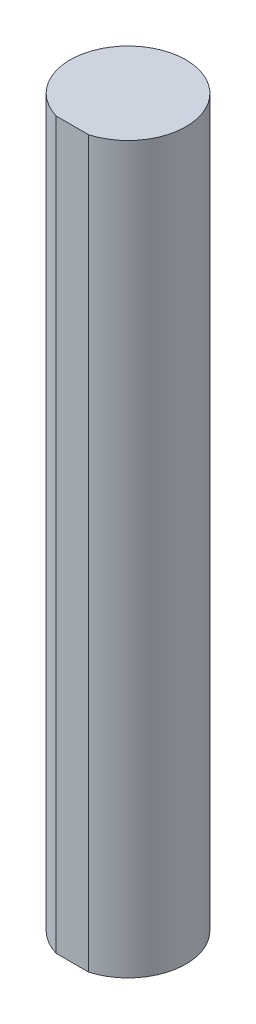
from build123d import *

# Parameters (mm, degrees)
SKETCH1_R           = 3.175
BOSS_EXTRUDE1_DEPTH = 39.751
SKETCH2_W           = 5.182885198
SKETCH2_H           = 0.565895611
CUT_EXTRUDE1_DEPTH  = 41.003790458


with BuildPart() as part:
    # Sketch1 → Boss-Extrude1 (new body)
    with BuildSketch(Plane(origin=(0, 0, 0), x_dir=(1, 0, 0), z_dir=(0, 1, 0))):
        with Locations(Location((0, 0, 0), (0, 0, 270))):
            Circle(SKETCH1_R)
    extrude(amount=BOSS_EXTRUDE1_DEPTH)

    # Sketch2 → Cut-Extrude1 (cut, through all)
    with BuildSketch(Plane.XZ):
        with Locations((-0.07185976, 3.330947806)):
            Rectangle(SKETCH2_W, SKETCH2_H)
    extrude(amount=-CUT_EXTRUDE1_DEPTH, mode=Mode.SUBTRACT)


solid = part.part
